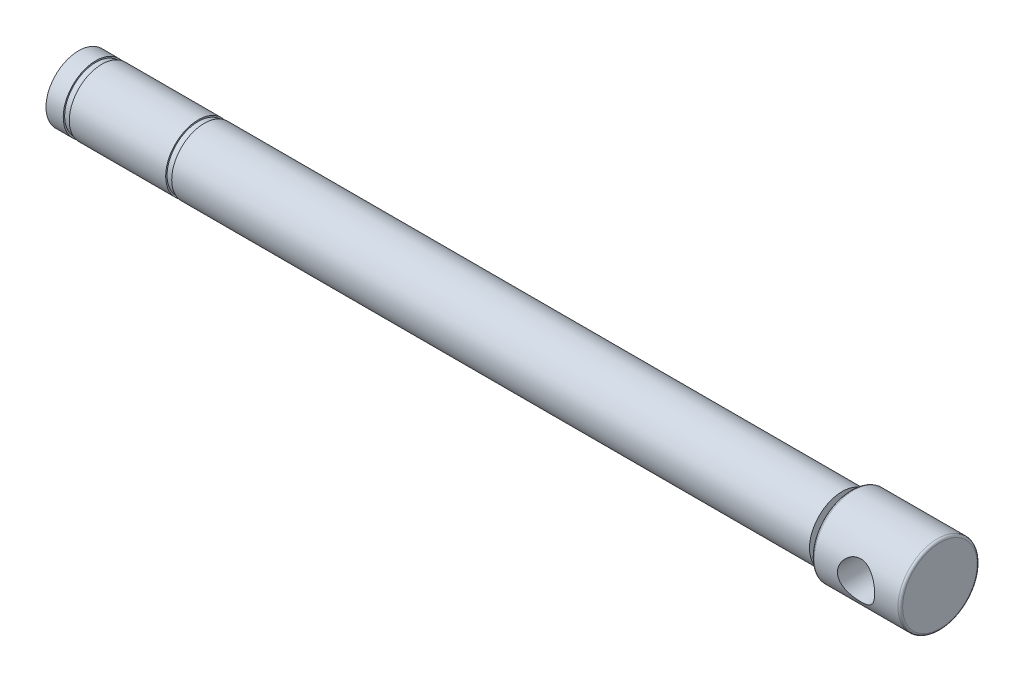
ISO-10303-21;
HEADER;
FILE_DESCRIPTION(('STEP AP214'),'2;1');
FILE_NAME('part.step','',(''),(''),'','','');
FILE_SCHEMA(('AUTOMOTIVE_DESIGN { 1 0 10303 214 1 1 1 1 }'));
ENDSEC;
DATA;
#1=APPLICATION_CONTEXT('core data for automotive mechanical design processes');
#2=APPLICATION_PROTOCOL_DEFINITION('international standard','automotive_design',2000,#1);
#3=PRODUCT_CONTEXT('',#1,'mechanical');
#4=PRODUCT('Part','Part','',(#3));
#5=PRODUCT_RELATED_PRODUCT_CATEGORY('part','',(#4));
#6=PRODUCT_DEFINITION_FORMATION('','',#4);
#7=PRODUCT_DEFINITION_CONTEXT('part definition',#1,'design');
#8=PRODUCT_DEFINITION('design','',#6,#7);
#9=PRODUCT_DEFINITION_SHAPE('','',#8);
#10=(LENGTH_UNIT() NAMED_UNIT(*) SI_UNIT(.MILLI.,.METRE.));
#11=(NAMED_UNIT(*) PLANE_ANGLE_UNIT() SI_UNIT($,.RADIAN.));
#12=(NAMED_UNIT(*) SI_UNIT($,.STERADIAN.) SOLID_ANGLE_UNIT());
#13=UNCERTAINTY_MEASURE_WITH_UNIT(LENGTH_MEASURE(1.E-05),#10,'distance_accuracy_value','');
#14=(GEOMETRIC_REPRESENTATION_CONTEXT(3) GLOBAL_UNCERTAINTY_ASSIGNED_CONTEXT((#13)) GLOBAL_UNIT_ASSIGNED_CONTEXT((#10,
#11,#12)) REPRESENTATION_CONTEXT('',''));
#15=CARTESIAN_POINT('',(0.,0.,0.));
#16=DIRECTION('',(0.,0.,1.));
#17=DIRECTION('',(1.,0.,0.));
#18=AXIS2_PLACEMENT_3D('',#15,#16,#17);
#19=CARTESIAN_POINT('',(0.,0.,0.));
#20=DIRECTION('',(-1.,0.,0.));
#21=DIRECTION('',(0.,0.,1.));
#22=AXIS2_PLACEMENT_3D('',#19,#20,#21);
#23=PLANE('',#22);
#24=CARTESIAN_POINT('',(0.,0.,0.));
#25=DIRECTION('',(-1.,0.,0.));
#26=DIRECTION('',(0.,0.,1.));
#27=AXIS2_PLACEMENT_3D('',#24,#25,#26);
#28=CIRCLE('',#27,8.);
#29=CARTESIAN_POINT('',(0.,0.,8.));
#30=VERTEX_POINT('',#29);
#31=EDGE_CURVE('E10',#30,#30,#28,.F.);
#32=ORIENTED_EDGE('',*,*,#31,.T.);
#33=EDGE_LOOP('',(#32));
#34=FACE_BOUND('',#33,.T.);
#35=ADVANCED_FACE('F41',(#34),#23,.F.);
#36=CARTESIAN_POINT('',(-788.991534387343,0.,0.));
#37=DIRECTION('',(-1.,0.,0.));
#38=DIRECTION('',(0.,0.,1.));
#39=AXIS2_PLACEMENT_3D('',#36,#37,#38);
#40=CYLINDRICAL_SURFACE('',#39,8.5);
#41=CARTESIAN_POINT('',(-18.5,0.,0.));
#42=DIRECTION('',(1.,0.,0.));
#43=DIRECTION('',(0.,0.,-1.));
#44=AXIS2_PLACEMENT_3D('',#41,#42,#43);
#45=CIRCLE('',#44,8.5);
#46=CARTESIAN_POINT('',(-18.5,0.,-8.5));
#47=VERTEX_POINT('',#46);
#48=EDGE_CURVE('E48',#47,#47,#45,.T.);
#49=ORIENTED_EDGE('',*,*,#48,.T.);
#50=EDGE_LOOP('',(#49));
#51=FACE_BOUND('',#50,.T.);
#52=CARTESIAN_POINT('',(-0.499999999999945,0.,0.));
#53=DIRECTION('',(-1.,0.,0.));
#54=DIRECTION('',(0.,0.,1.));
#55=AXIS2_PLACEMENT_3D('',#52,#53,#54);
#56=CIRCLE('',#55,8.5);
#57=CARTESIAN_POINT('',(-0.499999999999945,0.,8.5));
#58=VERTEX_POINT('',#57);
#59=EDGE_CURVE('E52',#58,#58,#56,.T.);
#60=ORIENTED_EDGE('',*,*,#59,.T.);
#61=EDGE_LOOP('',(#60));
#62=FACE_BOUND('',#61,.T.);
#63=CARTESIAN_POINT('',(-5.49999999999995,0.,-8.5));
#64=CARTESIAN_POINT('',(-5.50000074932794,0.105920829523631,-8.49999936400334));
#65=CARTESIAN_POINT('',(-5.50421268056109,0.211860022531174,-8.49801502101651));
#66=CARTESIAN_POINT('',(-5.52101486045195,0.422966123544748,-8.49012777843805));
#67=CARTESIAN_POINT('',(-5.53360937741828,0.528132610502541,-8.48422288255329));
#68=CARTESIAN_POINT('',(-5.56706638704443,0.737045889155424,-8.4686330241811));
#69=CARTESIAN_POINT('',(-5.58794272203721,0.840790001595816,-8.45894173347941));
#70=CARTESIAN_POINT('',(-5.63772670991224,1.04594904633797,-8.43603431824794));
#71=CARTESIAN_POINT('',(-5.66663764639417,1.14736300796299,-8.4228167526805));
#72=CARTESIAN_POINT('',(-5.76474111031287,1.44623273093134,-8.37846669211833));
#73=CARTESIAN_POINT('',(-5.84547055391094,1.63933546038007,-8.34255599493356));
#74=CARTESIAN_POINT('',(-6.03481715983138,2.00891027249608,-8.2613683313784));
#75=CARTESIAN_POINT('',(-6.14342994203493,2.1853849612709,-8.21609283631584));
#76=CARTESIAN_POINT('',(-6.39238988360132,2.52784117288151,-8.11747960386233));
#77=CARTESIAN_POINT('',(-6.53416176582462,2.69269976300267,-8.06383417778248));
#78=CARTESIAN_POINT('',(-6.84231856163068,2.99729378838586,-7.95565312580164));
#79=CARTESIAN_POINT('',(-7.0087198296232,3.137012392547,-7.90111692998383));
#80=CARTESIAN_POINT('',(-7.37494967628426,3.39672201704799,-7.79316229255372));
#81=CARTESIAN_POINT('',(-7.57626643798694,3.51477942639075,-7.74006019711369));
#82=CARTESIAN_POINT('',(-7.89282031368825,3.6647869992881,-7.66957560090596));
#83=CARTESIAN_POINT('',(-8.00080885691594,3.71028773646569,-7.64760267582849));
#84=CARTESIAN_POINT('',(-8.22097522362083,3.79181305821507,-7.60751068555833));
#85=CARTESIAN_POINT('',(-8.33315065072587,3.82784297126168,-7.58938945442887));
#86=CARTESIAN_POINT('',(-8.55448155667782,3.88824055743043,-7.55861564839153));
#87=CARTESIAN_POINT('',(-8.66345570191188,3.91314725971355,-7.54571413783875));
#88=CARTESIAN_POINT('',(-8.88349498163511,3.95378655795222,-7.52449993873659));
#89=CARTESIAN_POINT('',(-8.99455903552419,3.96952376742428,-7.51618494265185));
#90=CARTESIAN_POINT('',(-9.21782564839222,3.99161070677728,-7.50447875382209));
#91=CARTESIAN_POINT('',(-9.33002766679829,3.99796470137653,-7.50108532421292));
#92=CARTESIAN_POINT('',(-9.55460159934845,4.00120335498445,-7.49935834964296));
#93=CARTESIAN_POINT('',(-9.66697349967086,3.99808874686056,-7.50102441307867));
#94=CARTESIAN_POINT('',(-9.8793054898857,3.98324658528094,-7.50891521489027));
#95=CARTESIAN_POINT('',(-9.97934931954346,3.97244137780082,-7.51465158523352));
#96=CARTESIAN_POINT('',(-10.1780653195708,3.94339031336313,-7.52993576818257));
#97=CARTESIAN_POINT('',(-10.2767370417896,3.92514208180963,-7.53948479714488));
#98=CARTESIAN_POINT('',(-10.5696580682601,3.85950566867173,-7.57342149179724));
#99=CARTESIAN_POINT('',(-10.7609717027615,3.80121434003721,-7.60310538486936));
#100=CARTESIAN_POINT('',(-11.1352529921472,3.65612484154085,-7.67393923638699));
#101=CARTESIAN_POINT('',(-11.3179251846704,3.56869839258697,-7.71533856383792));
#102=CARTESIAN_POINT('',(-11.6668590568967,3.36826741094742,-7.80492256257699));
#103=CARTESIAN_POINT('',(-11.8331134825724,3.25525164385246,-7.8531102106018));
#104=CARTESIAN_POINT('',(-12.1638196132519,2.99223981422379,-7.95729971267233));
#105=CARTESIAN_POINT('',(-12.3260373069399,2.83953588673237,-8.01357629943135));
#106=CARTESIAN_POINT('',(-12.6234289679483,2.50872093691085,-8.12321857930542));
#107=CARTESIAN_POINT('',(-12.7585927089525,2.33060035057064,-8.17658316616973));
#108=CARTESIAN_POINT('',(-13.0026253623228,1.94561233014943,-8.27680712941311));
#109=CARTESIAN_POINT('',(-13.1103443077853,1.73792854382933,-8.3233550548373));
#110=CARTESIAN_POINT('',(-13.2884938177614,1.30463526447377,-8.40215855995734));
#111=CARTESIAN_POINT('',(-13.3589507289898,1.07903856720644,-8.43442423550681));
#112=CARTESIAN_POINT('',(-13.4553454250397,0.634757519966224,-8.47897905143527));
#113=CARTESIAN_POINT('',(-13.4842641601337,0.416854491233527,-8.49260202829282));
#114=CARTESIAN_POINT('',(-13.5059413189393,-0.0211065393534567,-8.50279098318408));
#115=CARTESIAN_POINT('',(-13.4987141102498,-0.241163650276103,-8.49936373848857));
#116=CARTESIAN_POINT('',(-13.4501988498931,-0.66160393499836,-8.47665493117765));
#117=CARTESIAN_POINT('',(-13.4112191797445,-0.862319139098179,-8.45844813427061));
#118=CARTESIAN_POINT('',(-13.3037719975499,-1.25402467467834,-8.40930479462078));
#119=CARTESIAN_POINT('',(-13.2353010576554,-1.44501387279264,-8.3783667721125));
#120=CARTESIAN_POINT('',(-13.0687704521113,-1.81850852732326,-8.30544142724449));
#121=CARTESIAN_POINT('',(-12.969872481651,-2.00057792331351,-8.26314604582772));
#122=CARTESIAN_POINT('',(-12.746203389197,-2.34618235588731,-8.17174595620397));
#123=CARTESIAN_POINT('',(-12.6214209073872,-2.50970920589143,-8.12263826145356));
#124=CARTESIAN_POINT('',(-12.3366715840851,-2.82896769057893,-8.01733494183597));
#125=CARTESIAN_POINT('',(-12.1745608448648,-2.98270771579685,-7.9608975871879));
#126=CARTESIAN_POINT('',(-11.8262607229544,-3.2616324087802,-7.85075053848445));
#127=CARTESIAN_POINT('',(-11.6400593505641,-3.38680277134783,-7.79704222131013));
#128=CARTESIAN_POINT('',(-11.3424601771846,-3.5523035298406,-7.72236890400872));
#129=CARTESIAN_POINT('',(-11.2382955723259,-3.60443662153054,-7.69810471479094));
#130=CARTESIAN_POINT('',(-11.0252389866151,-3.69962678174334,-7.65281245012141));
#131=CARTESIAN_POINT('',(-10.9163491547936,-3.74268792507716,-7.63178292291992));
#132=CARTESIAN_POINT('',(-10.6946552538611,-3.81923352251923,-7.593766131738));
#133=CARTESIAN_POINT('',(-10.5818539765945,-3.85272465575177,-7.57677604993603));
#134=CARTESIAN_POINT('',(-10.3531590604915,-3.90973143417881,-7.54751816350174));
#135=CARTESIAN_POINT('',(-10.2372658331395,-3.93324839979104,-7.53524973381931));
#136=CARTESIAN_POINT('',(-10.0140715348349,-3.9682875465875,-7.51685090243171));
#137=CARTESIAN_POINT('',(-9.90694826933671,-3.98070649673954,-7.51026354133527));
#138=CARTESIAN_POINT('',(-9.69186992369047,-3.99685057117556,-7.50168447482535));
#139=CARTESIAN_POINT('',(-9.58391491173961,-4.00057640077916,-7.49969239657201));
#140=CARTESIAN_POINT('',(-9.36809369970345,-3.99927964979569,-7.50038437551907));
#141=CARTESIAN_POINT('',(-9.26022748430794,-3.99425921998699,-7.50306728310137));
#142=CARTESIAN_POINT('',(-9.04549117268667,-3.97555717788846,-7.51299167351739));
#143=CARTESIAN_POINT('',(-8.9386210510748,-3.96187578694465,-7.52023303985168));
#144=CARTESIAN_POINT('',(-8.63678379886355,-3.91078253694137,-7.54700369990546));
#145=CARTESIAN_POINT('',(-8.44391024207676,-3.86308587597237,-7.57174585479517));
#146=CARTESIAN_POINT('',(-8.06912717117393,-3.74053281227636,-7.63302256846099));
#147=CARTESIAN_POINT('',(-7.88722096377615,-3.66566826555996,-7.66956066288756));
#148=CARTESIAN_POINT('',(-7.52607535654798,-3.48525638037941,-7.75328975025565));
#149=CARTESIAN_POINT('',(-7.34781789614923,-3.37799958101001,-7.8010276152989));
#150=CARTESIAN_POINT('',(-7.01073250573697,-3.13789987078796,-7.9006619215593));
#151=CARTESIAN_POINT('',(-6.85191385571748,-3.00504481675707,-7.95256032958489));
#152=CARTESIAN_POINT('',(-6.54130791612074,-2.70148560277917,-8.06105129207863));
#153=CARTESIAN_POINT('',(-6.39191901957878,-2.52829529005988,-8.11757837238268));
#154=CARTESIAN_POINT('',(-6.12389359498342,-2.15735448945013,-8.22392358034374));
#155=CARTESIAN_POINT('',(-6.00527185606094,-1.95959225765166,-8.27373847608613));
#156=CARTESIAN_POINT('',(-5.85382329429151,-1.64883807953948,-8.33921916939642));
#157=CARTESIAN_POINT('',(-5.80780114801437,-1.54306187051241,-8.35948351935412));
#158=CARTESIAN_POINT('',(-5.7249058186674,-1.32739711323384,-8.39642484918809));
#159=CARTESIAN_POINT('',(-5.68802818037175,-1.21751059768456,-8.41310357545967));
#160=CARTESIAN_POINT('',(-5.6239239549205,-0.99471002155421,-8.44234302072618));
#161=CARTESIAN_POINT('',(-5.59667516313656,-0.881803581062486,-8.45491320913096));
#162=CARTESIAN_POINT('',(-5.55206957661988,-0.653706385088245,-8.47559798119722));
#163=CARTESIAN_POINT('',(-5.53470628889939,-0.538517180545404,-8.48371548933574));
#164=CARTESIAN_POINT('',(-5.51494325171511,-0.352566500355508,-8.49297582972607));
#165=CARTESIAN_POINT('',(-5.50934274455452,-0.282201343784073,-8.49560679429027));
#166=CARTESIAN_POINT('',(-5.50187082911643,-0.141226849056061,-8.49911911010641));
#167=CARTESIAN_POINT('',(-5.49999950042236,-0.0706175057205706,-8.50000042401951));
#168=CARTESIAN_POINT('',(-5.49999999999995,0.,-8.5));
#169=B_SPLINE_CURVE_WITH_KNOTS('',3,(#63,#64,#65,#66,#67,#68,#69,#70,#71,#72,#73,#74,#75,#76,
#77,#78,#79,#80,#81,#82,#83,#84,#85,#86,#87,#88,#89,#90,#91,#92,#93,#94,#95,#96,#97,#98,#99,
#100,#101,#102,#103,#104,#105,#106,#107,#108,#109,#110,#111,#112,#113,#114,#115,#116,#117,#118,
#119,#120,#121,#122,#123,#124,#125,#126,#127,#128,#129,#130,#131,#132,#133,#134,#135,#136,#137,
#138,#139,#140,#141,#142,#143,#144,#145,#146,#147,#148,#149,#150,#151,#152,#153,#154,#155,#156,
#157,#158,#159,#160,#161,#162,#163,#164,#165,#166,#167,#168),.UNSPECIFIED.,.T.,.F.,(4,2,2,2,2,2,
2,2,2,2,2,2,2,2,2,2,2,2,2,2,2,2,2,2,2,2,2,2,2,2,2,2,2,2,2,2,2,2,2,2,2,2,2,2,2,2,2,2,2,2,2,2,4),
(0.,0.317691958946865,0.635545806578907,0.953933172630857,1.27245084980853,1.90641831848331,
2.54028625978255,3.20927011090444,3.87870019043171,4.59271472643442,4.9499749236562,
5.30703368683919,5.64414705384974,5.98109065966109,6.31788107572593,6.65464542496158,
6.95664409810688,7.25873919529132,7.86245825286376,8.48014370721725,9.09810086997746,
9.78441925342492,10.47099657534,11.1828261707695,11.8941517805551,12.5513228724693,
13.208232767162,13.8212448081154,14.434328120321,15.0660994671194,15.6981486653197,
16.3864937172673,17.0751826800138,17.4317298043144,17.7881164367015,18.1442537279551,
18.5003438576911,18.8240303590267,19.1476905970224,19.4712712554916,19.7948436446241,
20.3926285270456,20.9905927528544,21.6283252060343,22.2663609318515,22.9699416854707,
23.6738600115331,24.0248228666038,24.3756143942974,24.7255916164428,25.0753387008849,
25.2871396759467,25.498945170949),.UNSPECIFIED.);
#170=CARTESIAN_POINT('',(-5.49999999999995,0.,-8.5));
#171=VERTEX_POINT('',#170);
#172=EDGE_CURVE('E61',#171,#171,#169,.T.);
#173=ORIENTED_EDGE('',*,*,#172,.T.);
#174=EDGE_LOOP('',(#173));
#175=FACE_BOUND('',#174,.T.);
#176=CARTESIAN_POINT('',(-5.49999999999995,0.,8.5));
#177=CARTESIAN_POINT('',(-5.50000074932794,-0.105920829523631,8.49999936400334));
#178=CARTESIAN_POINT('',(-5.50421268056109,-0.211860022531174,8.49801502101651));
#179=CARTESIAN_POINT('',(-5.52101486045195,-0.422966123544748,8.49012777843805));
#180=CARTESIAN_POINT('',(-5.53360937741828,-0.528132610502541,8.48422288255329));
#181=CARTESIAN_POINT('',(-5.56706638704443,-0.737045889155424,8.4686330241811));
#182=CARTESIAN_POINT('',(-5.58794272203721,-0.840790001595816,8.45894173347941));
#183=CARTESIAN_POINT('',(-5.63772670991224,-1.04594904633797,8.43603431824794));
#184=CARTESIAN_POINT('',(-5.66663764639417,-1.14736300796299,8.4228167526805));
#185=CARTESIAN_POINT('',(-5.76474111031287,-1.44623273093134,8.37846669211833));
#186=CARTESIAN_POINT('',(-5.84547055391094,-1.63933546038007,8.34255599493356));
#187=CARTESIAN_POINT('',(-6.03481715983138,-2.00891027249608,8.2613683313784));
#188=CARTESIAN_POINT('',(-6.14342994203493,-2.1853849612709,8.21609283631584));
#189=CARTESIAN_POINT('',(-6.39238988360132,-2.52784117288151,8.11747960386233));
#190=CARTESIAN_POINT('',(-6.53416176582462,-2.69269976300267,8.06383417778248));
#191=CARTESIAN_POINT('',(-6.84231856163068,-2.99729378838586,7.95565312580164));
#192=CARTESIAN_POINT('',(-7.0087198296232,-3.137012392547,7.90111692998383));
#193=CARTESIAN_POINT('',(-7.37494967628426,-3.39672201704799,7.79316229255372));
#194=CARTESIAN_POINT('',(-7.57626643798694,-3.51477942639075,7.74006019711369));
#195=CARTESIAN_POINT('',(-7.89282031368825,-3.6647869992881,7.66957560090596));
#196=CARTESIAN_POINT('',(-8.00080885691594,-3.71028773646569,7.64760267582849));
#197=CARTESIAN_POINT('',(-8.22097522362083,-3.79181305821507,7.60751068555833));
#198=CARTESIAN_POINT('',(-8.33315065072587,-3.82784297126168,7.58938945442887));
#199=CARTESIAN_POINT('',(-8.55448155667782,-3.88824055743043,7.55861564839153));
#200=CARTESIAN_POINT('',(-8.66345570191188,-3.91314725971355,7.54571413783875));
#201=CARTESIAN_POINT('',(-8.88349498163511,-3.95378655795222,7.52449993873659));
#202=CARTESIAN_POINT('',(-8.99455903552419,-3.96952376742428,7.51618494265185));
#203=CARTESIAN_POINT('',(-9.21782564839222,-3.99161070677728,7.50447875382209));
#204=CARTESIAN_POINT('',(-9.33002766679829,-3.99796470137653,7.50108532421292));
#205=CARTESIAN_POINT('',(-9.55460159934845,-4.00120335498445,7.49935834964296));
#206=CARTESIAN_POINT('',(-9.66697349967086,-3.99808874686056,7.50102441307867));
#207=CARTESIAN_POINT('',(-9.8793054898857,-3.98324658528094,7.50891521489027));
#208=CARTESIAN_POINT('',(-9.97934931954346,-3.97244137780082,7.51465158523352));
#209=CARTESIAN_POINT('',(-10.1780653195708,-3.94339031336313,7.52993576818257));
#210=CARTESIAN_POINT('',(-10.2767370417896,-3.92514208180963,7.53948479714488));
#211=CARTESIAN_POINT('',(-10.5696580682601,-3.85950566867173,7.57342149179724));
#212=CARTESIAN_POINT('',(-10.7609717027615,-3.80121434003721,7.60310538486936));
#213=CARTESIAN_POINT('',(-11.1352529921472,-3.65612484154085,7.67393923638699));
#214=CARTESIAN_POINT('',(-11.3179251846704,-3.56869839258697,7.71533856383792));
#215=CARTESIAN_POINT('',(-11.6668590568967,-3.36826741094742,7.80492256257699));
#216=CARTESIAN_POINT('',(-11.8331134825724,-3.25525164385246,7.8531102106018));
#217=CARTESIAN_POINT('',(-12.1638196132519,-2.99223981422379,7.95729971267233));
#218=CARTESIAN_POINT('',(-12.3260373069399,-2.83953588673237,8.01357629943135));
#219=CARTESIAN_POINT('',(-12.6234289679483,-2.50872093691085,8.12321857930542));
#220=CARTESIAN_POINT('',(-12.7585927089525,-2.33060035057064,8.17658316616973));
#221=CARTESIAN_POINT('',(-13.0026253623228,-1.94561233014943,8.27680712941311));
#222=CARTESIAN_POINT('',(-13.1103443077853,-1.73792854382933,8.3233550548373));
#223=CARTESIAN_POINT('',(-13.2884938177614,-1.30463526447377,8.40215855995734));
#224=CARTESIAN_POINT('',(-13.3589507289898,-1.07903856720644,8.43442423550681));
#225=CARTESIAN_POINT('',(-13.4553454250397,-0.634757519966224,8.47897905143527));
#226=CARTESIAN_POINT('',(-13.4842641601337,-0.416854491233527,8.49260202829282));
#227=CARTESIAN_POINT('',(-13.5059413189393,0.0211065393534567,8.50279098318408));
#228=CARTESIAN_POINT('',(-13.4987141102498,0.241163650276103,8.49936373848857));
#229=CARTESIAN_POINT('',(-13.4501988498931,0.66160393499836,8.47665493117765));
#230=CARTESIAN_POINT('',(-13.4112191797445,0.862319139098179,8.45844813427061));
#231=CARTESIAN_POINT('',(-13.3037719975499,1.25402467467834,8.40930479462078));
#232=CARTESIAN_POINT('',(-13.2353010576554,1.44501387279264,8.3783667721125));
#233=CARTESIAN_POINT('',(-13.0687704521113,1.81850852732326,8.30544142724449));
#234=CARTESIAN_POINT('',(-12.969872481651,2.00057792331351,8.26314604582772));
#235=CARTESIAN_POINT('',(-12.746203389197,2.34618235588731,8.17174595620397));
#236=CARTESIAN_POINT('',(-12.6214209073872,2.50970920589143,8.12263826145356));
#237=CARTESIAN_POINT('',(-12.3366715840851,2.82896769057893,8.01733494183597));
#238=CARTESIAN_POINT('',(-12.1745608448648,2.98270771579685,7.9608975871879));
#239=CARTESIAN_POINT('',(-11.8262607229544,3.2616324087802,7.85075053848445));
#240=CARTESIAN_POINT('',(-11.6400593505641,3.38680277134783,7.79704222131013));
#241=CARTESIAN_POINT('',(-11.3424601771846,3.5523035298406,7.72236890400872));
#242=CARTESIAN_POINT('',(-11.2382955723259,3.60443662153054,7.69810471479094));
#243=CARTESIAN_POINT('',(-11.0252389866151,3.69962678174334,7.65281245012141));
#244=CARTESIAN_POINT('',(-10.9163491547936,3.74268792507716,7.63178292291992));
#245=CARTESIAN_POINT('',(-10.6946552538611,3.81923352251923,7.593766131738));
#246=CARTESIAN_POINT('',(-10.5818539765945,3.85272465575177,7.57677604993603));
#247=CARTESIAN_POINT('',(-10.3531590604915,3.90973143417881,7.54751816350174));
#248=CARTESIAN_POINT('',(-10.2372658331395,3.93324839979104,7.53524973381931));
#249=CARTESIAN_POINT('',(-10.0140715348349,3.9682875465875,7.51685090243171));
#250=CARTESIAN_POINT('',(-9.90694826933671,3.98070649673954,7.51026354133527));
#251=CARTESIAN_POINT('',(-9.69186992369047,3.99685057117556,7.50168447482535));
#252=CARTESIAN_POINT('',(-9.58391491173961,4.00057640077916,7.49969239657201));
#253=CARTESIAN_POINT('',(-9.36809369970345,3.99927964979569,7.50038437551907));
#254=CARTESIAN_POINT('',(-9.26022748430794,3.99425921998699,7.50306728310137));
#255=CARTESIAN_POINT('',(-9.04549117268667,3.97555717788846,7.51299167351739));
#256=CARTESIAN_POINT('',(-8.9386210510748,3.96187578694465,7.52023303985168));
#257=CARTESIAN_POINT('',(-8.63678379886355,3.91078253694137,7.54700369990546));
#258=CARTESIAN_POINT('',(-8.44391024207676,3.86308587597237,7.57174585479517));
#259=CARTESIAN_POINT('',(-8.06912717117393,3.74053281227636,7.63302256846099));
#260=CARTESIAN_POINT('',(-7.88722096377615,3.66566826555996,7.66956066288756));
#261=CARTESIAN_POINT('',(-7.52607535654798,3.48525638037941,7.75328975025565));
#262=CARTESIAN_POINT('',(-7.34781789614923,3.37799958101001,7.8010276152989));
#263=CARTESIAN_POINT('',(-7.01073250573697,3.13789987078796,7.9006619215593));
#264=CARTESIAN_POINT('',(-6.85191385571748,3.00504481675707,7.95256032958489));
#265=CARTESIAN_POINT('',(-6.54130791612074,2.70148560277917,8.06105129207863));
#266=CARTESIAN_POINT('',(-6.39191901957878,2.52829529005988,8.11757837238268));
#267=CARTESIAN_POINT('',(-6.12389359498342,2.15735448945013,8.22392358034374));
#268=CARTESIAN_POINT('',(-6.00527185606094,1.95959225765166,8.27373847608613));
#269=CARTESIAN_POINT('',(-5.85382329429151,1.64883807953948,8.33921916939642));
#270=CARTESIAN_POINT('',(-5.80780114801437,1.54306187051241,8.35948351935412));
#271=CARTESIAN_POINT('',(-5.7249058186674,1.32739711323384,8.39642484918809));
#272=CARTESIAN_POINT('',(-5.68802818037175,1.21751059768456,8.41310357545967));
#273=CARTESIAN_POINT('',(-5.6239239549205,0.99471002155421,8.44234302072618));
#274=CARTESIAN_POINT('',(-5.59667516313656,0.881803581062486,8.45491320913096));
#275=CARTESIAN_POINT('',(-5.55206957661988,0.653706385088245,8.47559798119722));
#276=CARTESIAN_POINT('',(-5.53470628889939,0.538517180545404,8.48371548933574));
#277=CARTESIAN_POINT('',(-5.51494325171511,0.352566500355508,8.49297582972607));
#278=CARTESIAN_POINT('',(-5.50934274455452,0.282201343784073,8.49560679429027));
#279=CARTESIAN_POINT('',(-5.50187082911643,0.141226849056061,8.49911911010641));
#280=CARTESIAN_POINT('',(-5.49999950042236,0.0706175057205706,8.50000042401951));
#281=CARTESIAN_POINT('',(-5.49999999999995,0.,8.5));
#282=B_SPLINE_CURVE_WITH_KNOTS('',3,(#176,#177,#178,#179,#180,#181,#182,#183,#184,#185,#186,
#187,#188,#189,#190,#191,#192,#193,#194,#195,#196,#197,#198,#199,#200,#201,#202,#203,#204,#205,
#206,#207,#208,#209,#210,#211,#212,#213,#214,#215,#216,#217,#218,#219,#220,#221,#222,#223,#224,
#225,#226,#227,#228,#229,#230,#231,#232,#233,#234,#235,#236,#237,#238,#239,#240,#241,#242,#243,
#244,#245,#246,#247,#248,#249,#250,#251,#252,#253,#254,#255,#256,#257,#258,#259,#260,#261,#262,
#263,#264,#265,#266,#267,#268,#269,#270,#271,#272,#273,#274,#275,#276,#277,#278,#279,#280,#281),
.UNSPECIFIED.,.T.,.F.,(4,2,2,2,2,2,2,2,2,2,2,2,2,2,2,2,2,2,2,2,2,2,2,2,2,2,2,2,2,2,2,2,2,2,2,2,
2,2,2,2,2,2,2,2,2,2,2,2,2,2,2,2,4),(0.,0.317691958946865,0.635545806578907,0.953933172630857,
1.27245084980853,1.90641831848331,2.54028625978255,3.20927011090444,3.87870019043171,
4.59271472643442,4.9499749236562,5.30703368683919,5.64414705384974,5.98109065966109,
6.31788107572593,6.65464542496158,6.95664409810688,7.25873919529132,7.86245825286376,
8.48014370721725,9.09810086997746,9.78441925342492,10.47099657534,11.1828261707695,
11.8941517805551,12.5513228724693,13.208232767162,13.8212448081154,14.434328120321,
15.0660994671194,15.6981486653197,16.3864937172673,17.0751826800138,17.4317298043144,
17.7881164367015,18.1442537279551,18.5003438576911,18.8240303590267,19.1476905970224,
19.4712712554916,19.7948436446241,20.3926285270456,20.9905927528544,21.6283252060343,
22.2663609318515,22.9699416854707,23.6738600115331,24.0248228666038,24.3756143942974,
24.7255916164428,25.0753387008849,25.2871396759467,25.498945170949),.UNSPECIFIED.);
#283=CARTESIAN_POINT('',(-5.49999999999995,0.,8.5));
#284=VERTEX_POINT('',#283);
#285=EDGE_CURVE('E69',#284,#284,#282,.T.);
#286=ORIENTED_EDGE('',*,*,#285,.T.);
#287=EDGE_LOOP('',(#286));
#288=FACE_BOUND('',#287,.T.);
#289=ADVANCED_FACE('F74',(#51,#62,#175,#288),#40,.T.);
#290=CARTESIAN_POINT('',(-19.,4.00000000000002,0.));
#291=DIRECTION('',(1.,0.,0.));
#292=DIRECTION('',(0.,0.,-1.));
#293=AXIS2_PLACEMENT_3D('',#290,#291,#292);
#294=PLANE('',#293);
#295=CARTESIAN_POINT('',(-19.,0.,0.));
#296=DIRECTION('',(1.,0.,0.));
#297=DIRECTION('',(0.,0.,-1.));
#298=AXIS2_PLACEMENT_3D('',#295,#296,#297);
#299=CIRCLE('',#298,8.);
#300=CARTESIAN_POINT('',(-19.,0.,-8.));
#301=VERTEX_POINT('',#300);
#302=EDGE_CURVE('E56',#301,#301,#299,.F.);
#303=ORIENTED_EDGE('',*,*,#302,.T.);
#304=EDGE_LOOP('',(#303));
#305=FACE_BOUND('',#304,.T.);
#306=CARTESIAN_POINT('',(-19.,0.,0.));
#307=DIRECTION('',(-1.,0.,0.));
#308=DIRECTION('',(0.,0.,1.));
#309=AXIS2_PLACEMENT_3D('',#306,#307,#308);
#310=CIRCLE('',#309,4.00000000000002);
#311=CARTESIAN_POINT('',(-19.,0.,4.00000000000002));
#312=VERTEX_POINT('',#311);
#313=EDGE_CURVE('E160',#312,#312,#310,.T.);
#314=ORIENTED_EDGE('',*,*,#313,.F.);
#315=EDGE_LOOP('',(#314));
#316=FACE_BOUND('',#315,.T.);
#317=ADVANCED_FACE('F131',(#305,#316),#294,.F.);
#318=CARTESIAN_POINT('',(-788.991534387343,0.,0.));
#319=DIRECTION('',(-1.,0.,0.));
#320=DIRECTION('',(0.,0.,1.));
#321=AXIS2_PLACEMENT_3D('',#318,#319,#320);
#322=CYLINDRICAL_SURFACE('',#321,4.00000000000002);
#323=CARTESIAN_POINT('',(-21.,0.,0.));
#324=DIRECTION('',(-1.,0.,0.));
#325=DIRECTION('',(0.,0.,1.));
#326=AXIS2_PLACEMENT_3D('',#323,#324,#325);
#327=CIRCLE('',#326,4.00000000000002);
#328=CARTESIAN_POINT('',(-21.,0.,4.00000000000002));
#329=VERTEX_POINT('',#328);
#330=EDGE_CURVE('E162',#329,#329,#327,.T.);
#331=ORIENTED_EDGE('',*,*,#330,.F.);
#332=EDGE_LOOP('',(#331));
#333=FACE_BOUND('',#332,.T.);
#334=ORIENTED_EDGE('',*,*,#313,.T.);
#335=EDGE_LOOP('',(#334));
#336=FACE_BOUND('',#335,.T.);
#337=ADVANCED_FACE('F128',(#333,#336),#322,.T.);
#338=CARTESIAN_POINT('',(-21.,7.00000000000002,0.));
#339=DIRECTION('',(-1.,0.,0.));
#340=DIRECTION('',(0.,0.,1.));
#341=AXIS2_PLACEMENT_3D('',#338,#339,#340);
#342=PLANE('',#341);
#343=CARTESIAN_POINT('',(-21.,0.,0.));
#344=DIRECTION('',(-1.,0.,0.));
#345=DIRECTION('',(0.,0.,1.));
#346=AXIS2_PLACEMENT_3D('',#343,#344,#345);
#347=CIRCLE('',#346,7.00000000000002);
#348=CARTESIAN_POINT('',(-21.,0.,7.00000000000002));
#349=VERTEX_POINT('',#348);
#350=EDGE_CURVE('E166',#349,#349,#347,.T.);
#351=ORIENTED_EDGE('',*,*,#350,.F.);
#352=EDGE_LOOP('',(#351));
#353=FACE_BOUND('',#352,.T.);
#354=ORIENTED_EDGE('',*,*,#330,.T.);
#355=EDGE_LOOP('',(#354));
#356=FACE_BOUND('',#355,.T.);
#357=ADVANCED_FACE('F124',(#353,#356),#342,.F.);
#358=CARTESIAN_POINT('',(-788.991534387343,0.,0.));
#359=DIRECTION('',(-1.,0.,0.));
#360=DIRECTION('',(0.,0.,1.));
#361=AXIS2_PLACEMENT_3D('',#358,#359,#360);
#362=CYLINDRICAL_SURFACE('',#361,7.00000000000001);
#363=CARTESIAN_POINT('',(-158.,0.,0.));
#364=DIRECTION('',(-1.,0.,0.));
#365=DIRECTION('',(0.,0.,1.));
#366=AXIS2_PLACEMENT_3D('',#363,#364,#365);
#367=CIRCLE('',#366,7.);
#368=CARTESIAN_POINT('',(-158.,0.,7.));
#369=VERTEX_POINT('',#368);
#370=EDGE_CURVE('E171',#369,#369,#367,.T.);
#371=ORIENTED_EDGE('',*,*,#370,.F.);
#372=EDGE_LOOP('',(#371));
#373=FACE_BOUND('',#372,.T.);
#374=ORIENTED_EDGE('',*,*,#350,.T.);
#375=EDGE_LOOP('',(#374));
#376=FACE_BOUND('',#375,.T.);
#377=ADVANCED_FACE('F120',(#373,#376),#362,.T.);
#378=CARTESIAN_POINT('',(-158.,7.,0.));
#379=DIRECTION('',(1.,0.,0.));
#380=DIRECTION('',(0.,0.,-1.));
#381=AXIS2_PLACEMENT_3D('',#378,#379,#380);
#382=PLANE('',#381);
#383=CARTESIAN_POINT('',(-158.,0.,0.));
#384=DIRECTION('',(-1.,0.,0.));
#385=DIRECTION('',(0.,0.,1.));
#386=AXIS2_PLACEMENT_3D('',#383,#384,#385);
#387=CIRCLE('',#386,6.7);
#388=CARTESIAN_POINT('',(-158.,0.,6.7));
#389=VERTEX_POINT('',#388);
#390=EDGE_CURVE('E174',#389,#389,#387,.T.);
#391=ORIENTED_EDGE('',*,*,#390,.F.);
#392=EDGE_LOOP('',(#391));
#393=FACE_BOUND('',#392,.T.);
#394=ORIENTED_EDGE('',*,*,#370,.T.);
#395=EDGE_LOOP('',(#394));
#396=FACE_BOUND('',#395,.T.);
#397=ADVANCED_FACE('F116',(#393,#396),#382,.F.);
#398=CARTESIAN_POINT('',(-788.991534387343,0.,0.));
#399=DIRECTION('',(-1.,0.,0.));
#400=DIRECTION('',(0.,0.,1.));
#401=AXIS2_PLACEMENT_3D('',#398,#399,#400);
#402=CYLINDRICAL_SURFACE('',#401,6.7);
#403=CARTESIAN_POINT('',(-159.3,0.,0.));
#404=DIRECTION('',(-1.,0.,0.));
#405=DIRECTION('',(0.,0.,1.));
#406=AXIS2_PLACEMENT_3D('',#403,#404,#405);
#407=CIRCLE('',#406,6.7);
#408=CARTESIAN_POINT('',(-159.3,0.,6.7));
#409=VERTEX_POINT('',#408);
#410=EDGE_CURVE('E177',#409,#409,#407,.T.);
#411=ORIENTED_EDGE('',*,*,#410,.F.);
#412=EDGE_LOOP('',(#411));
#413=FACE_BOUND('',#412,.T.);
#414=ORIENTED_EDGE('',*,*,#390,.T.);
#415=EDGE_LOOP('',(#414));
#416=FACE_BOUND('',#415,.T.);
#417=ADVANCED_FACE('F112',(#413,#416),#402,.T.);
#418=CARTESIAN_POINT('',(-159.3,6.7,0.));
#419=DIRECTION('',(-1.,0.,0.));
#420=DIRECTION('',(0.,0.,1.));
#421=AXIS2_PLACEMENT_3D('',#418,#419,#420);
#422=PLANE('',#421);
#423=CARTESIAN_POINT('',(-159.3,0.,0.));
#424=DIRECTION('',(-1.,0.,0.));
#425=DIRECTION('',(0.,0.,1.));
#426=AXIS2_PLACEMENT_3D('',#423,#424,#425);
#427=CIRCLE('',#426,7.);
#428=CARTESIAN_POINT('',(-159.3,0.,7.));
#429=VERTEX_POINT('',#428);
#430=EDGE_CURVE('E180',#429,#429,#427,.T.);
#431=ORIENTED_EDGE('',*,*,#430,.F.);
#432=EDGE_LOOP('',(#431));
#433=FACE_BOUND('',#432,.T.);
#434=ORIENTED_EDGE('',*,*,#410,.T.);
#435=EDGE_LOOP('',(#434));
#436=FACE_BOUND('',#435,.T.);
#437=ADVANCED_FACE('F108',(#433,#436),#422,.F.);
#438=CARTESIAN_POINT('',(-788.991534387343,0.,0.));
#439=DIRECTION('',(-1.,0.,0.));
#440=DIRECTION('',(0.,0.,1.));
#441=AXIS2_PLACEMENT_3D('',#438,#439,#440);
#442=CYLINDRICAL_SURFACE('',#441,7.);
#443=CARTESIAN_POINT('',(-180.,0.,0.));
#444=DIRECTION('',(-1.,0.,0.));
#445=DIRECTION('',(0.,0.,1.));
#446=AXIS2_PLACEMENT_3D('',#443,#444,#445);
#447=CIRCLE('',#446,7.);
#448=CARTESIAN_POINT('',(-180.,0.,7.));
#449=VERTEX_POINT('',#448);
#450=EDGE_CURVE('E183',#449,#449,#447,.T.);
#451=ORIENTED_EDGE('',*,*,#450,.F.);
#452=EDGE_LOOP('',(#451));
#453=FACE_BOUND('',#452,.T.);
#454=ORIENTED_EDGE('',*,*,#430,.T.);
#455=EDGE_LOOP('',(#454));
#456=FACE_BOUND('',#455,.T.);
#457=ADVANCED_FACE('F104',(#453,#456),#442,.T.);
#458=CARTESIAN_POINT('',(-180.,7.,0.));
#459=DIRECTION('',(1.,0.,0.));
#460=DIRECTION('',(0.,0.,-1.));
#461=AXIS2_PLACEMENT_3D('',#458,#459,#460);
#462=PLANE('',#461);
#463=CARTESIAN_POINT('',(-180.,0.,0.));
#464=DIRECTION('',(-1.,0.,0.));
#465=DIRECTION('',(0.,0.,1.));
#466=AXIS2_PLACEMENT_3D('',#463,#464,#465);
#467=CIRCLE('',#466,6.7);
#468=CARTESIAN_POINT('',(-180.,0.,6.7));
#469=VERTEX_POINT('',#468);
#470=EDGE_CURVE('E186',#469,#469,#467,.T.);
#471=ORIENTED_EDGE('',*,*,#470,.F.);
#472=EDGE_LOOP('',(#471));
#473=FACE_BOUND('',#472,.T.);
#474=ORIENTED_EDGE('',*,*,#450,.T.);
#475=EDGE_LOOP('',(#474));
#476=FACE_BOUND('',#475,.T.);
#477=ADVANCED_FACE('F100',(#473,#476),#462,.F.);
#478=CARTESIAN_POINT('',(-788.991534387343,0.,0.));
#479=DIRECTION('',(-1.,0.,0.));
#480=DIRECTION('',(0.,0.,1.));
#481=AXIS2_PLACEMENT_3D('',#478,#479,#480);
#482=CYLINDRICAL_SURFACE('',#481,6.7);
#483=CARTESIAN_POINT('',(-181.3,0.,0.));
#484=DIRECTION('',(-1.,0.,0.));
#485=DIRECTION('',(0.,0.,1.));
#486=AXIS2_PLACEMENT_3D('',#483,#484,#485);
#487=CIRCLE('',#486,6.7);
#488=CARTESIAN_POINT('',(-181.3,0.,6.7));
#489=VERTEX_POINT('',#488);
#490=EDGE_CURVE('E189',#489,#489,#487,.T.);
#491=ORIENTED_EDGE('',*,*,#490,.F.);
#492=EDGE_LOOP('',(#491));
#493=FACE_BOUND('',#492,.T.);
#494=ORIENTED_EDGE('',*,*,#470,.T.);
#495=EDGE_LOOP('',(#494));
#496=FACE_BOUND('',#495,.T.);
#497=ADVANCED_FACE('F96',(#493,#496),#482,.T.);
#498=CARTESIAN_POINT('',(-181.3,6.7,0.));
#499=DIRECTION('',(-1.,0.,0.));
#500=DIRECTION('',(0.,0.,1.));
#501=AXIS2_PLACEMENT_3D('',#498,#499,#500);
#502=PLANE('',#501);
#503=CARTESIAN_POINT('',(-181.3,0.,0.));
#504=DIRECTION('',(-1.,0.,0.));
#505=DIRECTION('',(0.,0.,1.));
#506=AXIS2_PLACEMENT_3D('',#503,#504,#505);
#507=CIRCLE('',#506,7.);
#508=CARTESIAN_POINT('',(-181.3,0.,7.));
#509=VERTEX_POINT('',#508);
#510=EDGE_CURVE('E192',#509,#509,#507,.T.);
#511=ORIENTED_EDGE('',*,*,#510,.F.);
#512=EDGE_LOOP('',(#511));
#513=FACE_BOUND('',#512,.T.);
#514=ORIENTED_EDGE('',*,*,#490,.T.);
#515=EDGE_LOOP('',(#514));
#516=FACE_BOUND('',#515,.T.);
#517=ADVANCED_FACE('F92',(#513,#516),#502,.F.);
#518=CARTESIAN_POINT('',(-788.991534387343,0.,0.));
#519=DIRECTION('',(-1.,0.,0.));
#520=DIRECTION('',(0.,0.,1.));
#521=AXIS2_PLACEMENT_3D('',#518,#519,#520);
#522=CYLINDRICAL_SURFACE('',#521,7.);
#523=CARTESIAN_POINT('',(-185.,0.,0.));
#524=DIRECTION('',(-1.,0.,0.));
#525=DIRECTION('',(0.,0.,1.));
#526=AXIS2_PLACEMENT_3D('',#523,#524,#525);
#527=CIRCLE('',#526,7.);
#528=CARTESIAN_POINT('',(-185.,0.,7.));
#529=VERTEX_POINT('',#528);
#530=EDGE_CURVE('E195',#529,#529,#527,.T.);
#531=ORIENTED_EDGE('',*,*,#530,.F.);
#532=EDGE_LOOP('',(#531));
#533=FACE_BOUND('',#532,.T.);
#534=ORIENTED_EDGE('',*,*,#510,.T.);
#535=EDGE_LOOP('',(#534));
#536=FACE_BOUND('',#535,.T.);
#537=ADVANCED_FACE('F88',(#533,#536),#522,.T.);
#538=CARTESIAN_POINT('',(-185.,7.,0.));
#539=DIRECTION('',(1.,0.,0.));
#540=DIRECTION('',(0.,0.,-1.));
#541=AXIS2_PLACEMENT_3D('',#538,#539,#540);
#542=PLANE('',#541);
#543=ORIENTED_EDGE('',*,*,#530,.T.);
#544=EDGE_LOOP('',(#543));
#545=FACE_BOUND('',#544,.T.);
#546=ADVANCED_FACE('F83',(#545),#542,.F.);
#547=CARTESIAN_POINT('',(-9.49999999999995,0.,-8.5));
#548=DIRECTION('',(0.,0.,1.));
#549=DIRECTION('',(1.,0.,0.));
#550=AXIS2_PLACEMENT_3D('',#547,#548,#549);
#551=CYLINDRICAL_SURFACE('',#550,4.);
#552=ORIENTED_EDGE('',*,*,#285,.F.);
#553=EDGE_LOOP('',(#552));
#554=FACE_BOUND('',#553,.T.);
#555=ORIENTED_EDGE('',*,*,#172,.F.);
#556=EDGE_LOOP('',(#555));
#557=FACE_BOUND('',#556,.T.);
#558=ADVANCED_FACE('F78',(#554,#557),#551,.F.);
#559=CARTESIAN_POINT('',(-18.5,0.,0.));
#560=DIRECTION('',(1.,0.,0.));
#561=DIRECTION('',(0.,0.,-1.));
#562=AXIS2_PLACEMENT_3D('',#559,#560,#561);
#563=TOROIDAL_SURFACE('',#562,8.,0.5);
#564=ORIENTED_EDGE('',*,*,#48,.F.);
#565=EDGE_LOOP('',(#564));
#566=FACE_BOUND('',#565,.T.);
#567=ORIENTED_EDGE('',*,*,#302,.F.);
#568=EDGE_LOOP('',(#567));
#569=FACE_BOUND('',#568,.T.);
#570=ADVANCED_FACE('F82',(#566,#569),#563,.T.);
#571=CARTESIAN_POINT('',(-0.499999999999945,0.,0.));
#572=DIRECTION('',(-1.,0.,0.));
#573=DIRECTION('',(0.,0.,1.));
#574=AXIS2_PLACEMENT_3D('',#571,#572,#573);
#575=TOROIDAL_SURFACE('',#574,8.,0.5);
#576=ORIENTED_EDGE('',*,*,#31,.F.);
#577=EDGE_LOOP('',(#576));
#578=FACE_BOUND('',#577,.T.);
#579=ORIENTED_EDGE('',*,*,#59,.F.);
#580=EDGE_LOOP('',(#579));
#581=FACE_BOUND('',#580,.T.);
#582=ADVANCED_FACE('F43',(#578,#581),#575,.T.);
#583=CLOSED_SHELL('',(#35,#289,#317,#337,#357,#377,#397,#417,#437,#457,#477,#497,#517,#537,#546,
#558,#570,#582));
#584=MANIFOLD_SOLID_BREP('B2',#583);
#585=ADVANCED_BREP_SHAPE_REPRESENTATION('',(#18,#584),#14);
#586=SHAPE_DEFINITION_REPRESENTATION(#9,#585);
ENDSEC;
END-ISO-10303-21;
